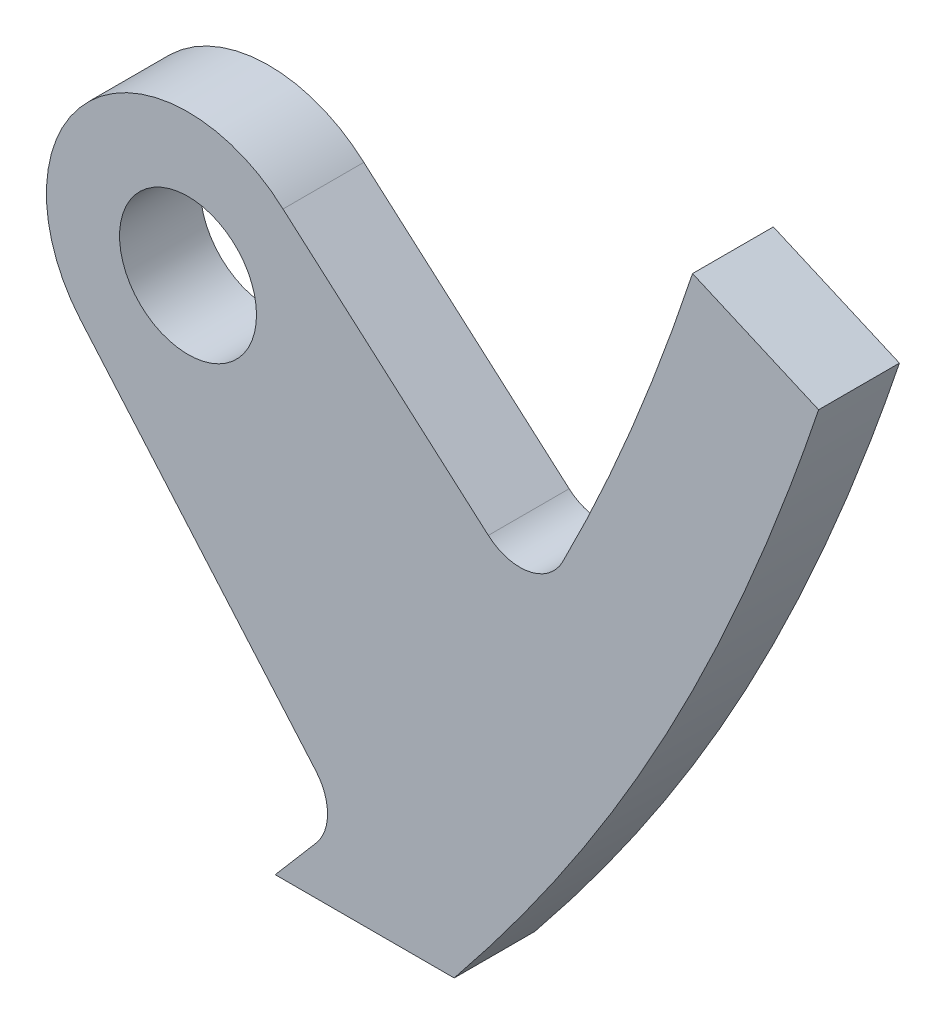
ISO-10303-21;
HEADER;
FILE_DESCRIPTION(('STEP AP214'),'2;1');
FILE_NAME('part.step','',(''),(''),'','','');
FILE_SCHEMA(('AUTOMOTIVE_DESIGN { 1 0 10303 214 1 1 1 1 }'));
ENDSEC;
DATA;
#1=APPLICATION_CONTEXT('core data for automotive mechanical design processes');
#2=APPLICATION_PROTOCOL_DEFINITION('international standard','automotive_design',2000,#1);
#3=PRODUCT_CONTEXT('',#1,'mechanical');
#4=PRODUCT('Part','Part','',(#3));
#5=PRODUCT_RELATED_PRODUCT_CATEGORY('part','',(#4));
#6=PRODUCT_DEFINITION_FORMATION('','',#4);
#7=PRODUCT_DEFINITION_CONTEXT('part definition',#1,'design');
#8=PRODUCT_DEFINITION('design','',#6,#7);
#9=PRODUCT_DEFINITION_SHAPE('','',#8);
#10=(LENGTH_UNIT() NAMED_UNIT(*) SI_UNIT(.MILLI.,.METRE.));
#11=(NAMED_UNIT(*) PLANE_ANGLE_UNIT() SI_UNIT($,.RADIAN.));
#12=(NAMED_UNIT(*) SI_UNIT($,.STERADIAN.) SOLID_ANGLE_UNIT());
#13=UNCERTAINTY_MEASURE_WITH_UNIT(LENGTH_MEASURE(1.E-05),#10,'distance_accuracy_value','');
#14=(GEOMETRIC_REPRESENTATION_CONTEXT(3) GLOBAL_UNCERTAINTY_ASSIGNED_CONTEXT((#13)) GLOBAL_UNIT_ASSIGNED_CONTEXT((#10,
#11,#12)) REPRESENTATION_CONTEXT('',''));
#15=CARTESIAN_POINT('',(0.,0.,0.));
#16=DIRECTION('',(0.,0.,1.));
#17=DIRECTION('',(1.,0.,0.));
#18=AXIS2_PLACEMENT_3D('',#15,#16,#17);
#19=CARTESIAN_POINT('',(-28.575,106.68,2.9972));
#20=CARTESIAN_POINT('',(-31.1223322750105,88.3122925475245,2.9972));
#21=CARTESIAN_POINT('',(-35.6949869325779,54.9592886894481,2.9972));
#22=CARTESIAN_POINT('',(-70.4253531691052,26.7634785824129,2.9972));
#23=CARTESIAN_POINT('',(-76.5696549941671,12.326423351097,2.9972));
#24=CARTESIAN_POINT('',(-76.2,0.,2.9972));
#25=B_SPLINE_CURVE_WITH_KNOTS('',3,(#19,#20,#21,#22,#23,#24),.UNSPECIFIED.,.F.,.F.,(4,1,1,4),
(0.,0.473853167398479,0.807071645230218,1.),.UNSPECIFIED.);
#26=DIRECTION('',(0.,0.,-1.));
#27=VECTOR('',#26,1.);
#28=SURFACE_OF_LINEAR_EXTRUSION('',#25,#27);
#29=CARTESIAN_POINT('',(-35.6183809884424,71.4990097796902,2.9972));
#30=VERTEX_POINT('',#29);
#31=CARTESIAN_POINT('',(-40.4376055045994,59.8291686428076,2.9972));
#32=VERTEX_POINT('',#31);
#33=EDGE_CURVE('E138',#30,#32,#25,.T.);
#34=ORIENTED_EDGE('',*,*,#33,.F.);
#35=DIRECTION('',(0.,0.,-1.));
#36=VECTOR('',#35,1.);
#37=CARTESIAN_POINT('',(-35.618380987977,71.4990097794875,2.9972));
#38=LINE('',#37,#36);
#39=CARTESIAN_POINT('',(-35.6183809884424,71.4990097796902,0.));
#40=VERTEX_POINT('',#39);
#41=EDGE_CURVE('E183',#30,#40,#38,.T.);
#42=ORIENTED_EDGE('',*,*,#41,.T.);
#43=CARTESIAN_POINT('',(-28.575,106.68,0.));
#44=CARTESIAN_POINT('',(-31.1223322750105,88.3122925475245,0.));
#45=CARTESIAN_POINT('',(-35.6949869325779,54.9592886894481,0.));
#46=CARTESIAN_POINT('',(-70.4253531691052,26.7634785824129,0.));
#47=CARTESIAN_POINT('',(-76.5696549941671,12.326423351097,0.));
#48=CARTESIAN_POINT('',(-76.2,0.,0.));
#49=B_SPLINE_CURVE_WITH_KNOTS('',3,(#43,#44,#45,#46,#47,#48),.UNSPECIFIED.,.F.,.F.,(4,1,1,4),
(0.,0.473853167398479,0.807071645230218,1.),.UNSPECIFIED.);
#50=CARTESIAN_POINT('',(-40.4376055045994,59.8291686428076,0.));
#51=VERTEX_POINT('',#50);
#52=EDGE_CURVE('E143',#40,#51,#49,.T.);
#53=ORIENTED_EDGE('',*,*,#52,.T.);
#54=DIRECTION('',(0.,0.,-1.));
#55=VECTOR('',#54,1.);
#56=CARTESIAN_POINT('',(-40.4376055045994,59.8291686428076,0.));
#57=LINE('',#56,#55);
#58=EDGE_CURVE('E186',#51,#32,#57,.F.);
#59=ORIENTED_EDGE('',*,*,#58,.T.);
#60=EDGE_LOOP('',(#34,#42,#53,#59));
#61=FACE_BOUND('',#60,.T.);
#62=ADVANCED_FACE('F33',(#61),#28,.F.);
#63=CARTESIAN_POINT('',(-49.5715588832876,46.2348557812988,0.));
#64=VERTEX_POINT('',#63);
#65=CARTESIAN_POINT('',(-51.0976316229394,44.45,0.));
#66=VERTEX_POINT('',#65);
#67=EDGE_CURVE('E129',#64,#66,#49,.T.);
#68=ORIENTED_EDGE('',*,*,#67,.T.);
#69=DIRECTION('',(0.,0.,-1.));
#70=VECTOR('',#69,1.);
#71=CARTESIAN_POINT('',(-51.0976316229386,44.45,2.9972));
#72=LINE('',#71,#70);
#73=CARTESIAN_POINT('',(-51.0976316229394,44.45,2.9972));
#74=VERTEX_POINT('',#73);
#75=EDGE_CURVE('E112',#66,#74,#72,.F.);
#76=ORIENTED_EDGE('',*,*,#75,.T.);
#77=CARTESIAN_POINT('',(-49.5715588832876,46.2348557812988,2.9972));
#78=VERTEX_POINT('',#77);
#79=EDGE_CURVE('E126',#78,#74,#25,.T.);
#80=ORIENTED_EDGE('',*,*,#79,.F.);
#81=DIRECTION('',(0.,0.,-1.));
#82=VECTOR('',#81,1.);
#83=CARTESIAN_POINT('',(-49.5715588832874,46.2348557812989,2.9972));
#84=LINE('',#83,#82);
#85=EDGE_CURVE('E200',#78,#64,#84,.T.);
#86=ORIENTED_EDGE('',*,*,#85,.T.);
#87=EDGE_LOOP('',(#68,#76,#80,#86));
#88=FACE_BOUND('',#87,.T.);
#89=ADVANCED_FACE('F124',(#88),#28,.F.);
#90=CARTESIAN_POINT('',(-71.12228275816,0.152274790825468,2.9972));
#91=CARTESIAN_POINT('',(-71.1360709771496,0.612053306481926,2.9972));
#92=CARTESIAN_POINT('',(-71.1567058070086,1.54979316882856,2.9972));
#93=CARTESIAN_POINT('',(-71.1645984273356,3.28211812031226,2.9972));
#94=CARTESIAN_POINT('',(-71.1167972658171,5.2861742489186,2.9972));
#95=CARTESIAN_POINT('',(-70.9730711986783,7.42161548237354,2.9972));
#96=CARTESIAN_POINT('',(-70.6767068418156,9.95097976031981,2.9972));
#97=CARTESIAN_POINT('',(-70.1305550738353,12.5718264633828,2.9972));
#98=CARTESIAN_POINT('',(-69.2453812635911,15.104636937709,2.9972));
#99=CARTESIAN_POINT('',(-68.1202374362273,17.3343932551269,2.9972));
#100=CARTESIAN_POINT('',(-66.672184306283,19.5510756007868,2.9972));
#101=CARTESIAN_POINT('',(-64.8630643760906,21.9349302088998,2.9972));
#102=CARTESIAN_POINT('',(-62.1184326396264,25.2082421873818,2.9972));
#103=CARTESIAN_POINT('',(-58.1371910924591,29.5028468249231,2.9972));
#104=CARTESIAN_POINT('',(-52.8597313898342,34.9642275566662,2.9972));
#105=CARTESIAN_POINT('',(-47.4482093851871,40.7915416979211,2.9972));
#106=CARTESIAN_POINT('',(-42.2515146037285,47.0604507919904,2.9972));
#107=CARTESIAN_POINT('',(-37.6918324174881,53.925317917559,2.9972));
#108=CARTESIAN_POINT('',(-34.0642333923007,61.0843459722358,2.9972));
#109=CARTESIAN_POINT('',(-31.169794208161,68.4657942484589,2.9972));
#110=CARTESIAN_POINT('',(-28.9001236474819,75.9824768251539,2.9972));
#111=CARTESIAN_POINT('',(-27.1227122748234,83.5631378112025,2.9972));
#112=CARTESIAN_POINT('',(-25.7154204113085,91.1411224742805,2.9972));
#113=CARTESIAN_POINT('',(-24.7522109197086,97.3940158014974,2.9972));
#114=CARTESIAN_POINT('',(-24.0485885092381,102.335722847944,2.9972));
#115=CARTESIAN_POINT('',(-23.7122461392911,104.762949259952,2.9972));
#116=CARTESIAN_POINT('',(-23.5431598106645,105.98215738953,2.9972));
#117=B_SPLINE_CURVE_WITH_KNOTS('',3,(#90,#91,#92,#93,#94,#95,#96,#97,#98,#99,#100,#101,#102,
#103,#104,#105,#106,#107,#108,#109,#110,#111,#112,#113,#114,#115,#116),.UNSPECIFIED.,.F.,.F.,(4,
1,1,1,1,1,1,1,1,1,1,1,1,1,1,1,1,1,1,1,1,1,1,1,4),(0.,0.0078125,0.015625,0.03125,0.046875,0.0625,
0.09375,0.125,0.15625,0.1875,0.21875,0.25,0.3125,0.375,0.4375,0.5,0.5625,0.625,0.6875,0.75,
0.8125,0.875,0.9375,0.96875,1.),.UNSPECIFIED.);
#118=DIRECTION('',(0.,0.,-1.));
#119=VECTOR('',#118,1.);
#120=SURFACE_OF_LINEAR_EXTRUSION('',#117,#119);
#121=CARTESIAN_POINT('',(-71.12228275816,0.152274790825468,0.));
#122=CARTESIAN_POINT('',(-71.1360709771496,0.612053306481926,0.));
#123=CARTESIAN_POINT('',(-71.1567058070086,1.54979316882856,0.));
#124=CARTESIAN_POINT('',(-71.1645984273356,3.28211812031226,0.));
#125=CARTESIAN_POINT('',(-71.1167972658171,5.2861742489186,0.));
#126=CARTESIAN_POINT('',(-70.9730711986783,7.42161548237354,0.));
#127=CARTESIAN_POINT('',(-70.6767068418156,9.95097976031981,0.));
#128=CARTESIAN_POINT('',(-70.1305550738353,12.5718264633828,0.));
#129=CARTESIAN_POINT('',(-69.2453812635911,15.104636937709,0.));
#130=CARTESIAN_POINT('',(-68.1202374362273,17.3343932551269,0.));
#131=CARTESIAN_POINT('',(-66.672184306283,19.5510756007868,0.));
#132=CARTESIAN_POINT('',(-64.8630643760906,21.9349302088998,0.));
#133=CARTESIAN_POINT('',(-62.1184326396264,25.2082421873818,0.));
#134=CARTESIAN_POINT('',(-58.1371910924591,29.5028468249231,0.));
#135=CARTESIAN_POINT('',(-52.8597313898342,34.9642275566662,0.));
#136=CARTESIAN_POINT('',(-47.4482093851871,40.7915416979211,0.));
#137=CARTESIAN_POINT('',(-42.2515146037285,47.0604507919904,0.));
#138=CARTESIAN_POINT('',(-37.6918324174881,53.925317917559,0.));
#139=CARTESIAN_POINT('',(-34.0642333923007,61.0843459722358,0.));
#140=CARTESIAN_POINT('',(-31.169794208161,68.4657942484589,0.));
#141=CARTESIAN_POINT('',(-28.9001236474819,75.9824768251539,0.));
#142=CARTESIAN_POINT('',(-27.1227122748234,83.5631378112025,0.));
#143=CARTESIAN_POINT('',(-25.7154204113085,91.1411224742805,0.));
#144=CARTESIAN_POINT('',(-24.7522109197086,97.3940158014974,0.));
#145=CARTESIAN_POINT('',(-24.0485885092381,102.335722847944,0.));
#146=CARTESIAN_POINT('',(-23.7122461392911,104.762949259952,0.));
#147=CARTESIAN_POINT('',(-23.5431598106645,105.98215738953,0.));
#148=B_SPLINE_CURVE_WITH_KNOTS('',3,(#121,#122,#123,#124,#125,#126,#127,#128,#129,#130,#131,
#132,#133,#134,#135,#136,#137,#138,#139,#140,#141,#142,#143,#144,#145,#146,#147),.UNSPECIFIED.,
.F.,.F.,(4,1,1,1,1,1,1,1,1,1,1,1,1,1,1,1,1,1,1,1,1,1,1,1,4),(0.,0.0078125,0.015625,0.03125,
0.046875,0.0625,0.09375,0.125,0.15625,0.1875,0.21875,0.25,0.3125,0.375,0.4375,0.5,0.5625,0.625,
0.6875,0.75,0.8125,0.875,0.9375,0.96875,1.),.UNSPECIFIED.);
#149=CARTESIAN_POINT('',(-44.459383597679,44.45,0.));
#150=VERTEX_POINT('',#149);
#151=CARTESIAN_POINT('',(-30.9421428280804,69.4618367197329,0.));
#152=VERTEX_POINT('',#151);
#153=EDGE_CURVE('E139',#150,#152,#148,.T.);
#154=ORIENTED_EDGE('',*,*,#153,.T.);
#155=DIRECTION('',(0.,0.,-1.));
#156=VECTOR('',#155,1.);
#157=CARTESIAN_POINT('',(-30.9421428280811,69.4618367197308,2.9972));
#158=LINE('',#157,#156);
#159=CARTESIAN_POINT('',(-30.9421428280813,69.4618367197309,2.9972));
#160=VERTEX_POINT('',#159);
#161=EDGE_CURVE('E48',#152,#160,#158,.F.);
#162=ORIENTED_EDGE('',*,*,#161,.T.);
#163=CARTESIAN_POINT('',(-44.459383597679,44.45,2.9972));
#164=VERTEX_POINT('',#163);
#165=EDGE_CURVE('E141',#164,#160,#117,.T.);
#166=ORIENTED_EDGE('',*,*,#165,.F.);
#167=DIRECTION('',(0.,0.,1.));
#168=VECTOR('',#167,1.);
#169=CARTESIAN_POINT('',(-44.459383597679,44.45,0.));
#170=LINE('',#169,#168);
#171=EDGE_CURVE('E115',#150,#164,#170,.T.);
#172=ORIENTED_EDGE('',*,*,#171,.F.);
#173=EDGE_LOOP('',(#154,#162,#166,#172));
#174=FACE_BOUND('',#173,.T.);
#175=ADVANCED_FACE('F160',(#174),#120,.F.);
#176=CARTESIAN_POINT('',(-46.430466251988,50.1960313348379,2.9972));
#177=DIRECTION('',(0.,0.,1.));
#178=DIRECTION('',(1.,0.,0.));
#179=AXIS2_PLACEMENT_3D('',#176,#177,#178);
#180=PLANE('',#179);
#181=DIRECTION('',(0.916781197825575,-0.399389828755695,0.));
#182=VECTOR('',#181,1.);
#183=CARTESIAN_POINT('',(-43.3685838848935,74.8753357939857,2.9972));
#184=LINE('',#183,#182);
#185=EDGE_CURVE('E130',#30,#160,#184,.T.);
#186=ORIENTED_EDGE('',*,*,#185,.F.);
#187=ORIENTED_EDGE('',*,*,#33,.T.);
#188=CARTESIAN_POINT('',(-42.0207648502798,60.6384216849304,2.9972));
#189=DIRECTION('',(0.,0.,1.));
#190=DIRECTION('',(1.,0.,0.));
#191=AXIS2_PLACEMENT_3D('',#188,#189,#190);
#192=CIRCLE('',#191,1.778);
#193=CARTESIAN_POINT('',(-43.1927780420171,59.3013842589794,2.9972));
#194=VERTEX_POINT('',#193);
#195=EDGE_CURVE('E55',#32,#194,#192,.F.);
#196=ORIENTED_EDGE('',*,*,#195,.T.);
#197=DIRECTION('',(-0.751989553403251,0.659175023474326,0.));
#198=VECTOR('',#197,1.);
#199=CARTESIAN_POINT('',(-39.0309458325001,55.6532274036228,2.9972));
#200=LINE('',#199,#198);
#201=CARTESIAN_POINT('',(-50.8086045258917,65.9772251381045,2.9972));
#202=VERTEX_POINT('',#201);
#203=EDGE_CURVE('E220',#194,#202,#200,.T.);
#204=ORIENTED_EDGE('',*,*,#203,.T.);
#205=CARTESIAN_POINT('',(-54.3317843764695,62.0810371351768,2.9972));
#206=DIRECTION('',(0.,0.,1.));
#207=DIRECTION('',(-1.,0.,0.));
#208=AXIS2_PLACEMENT_3D('',#205,#206,#207);
#209=CIRCLE('',#208,5.25291130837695);
#210=CARTESIAN_POINT('',(-58.3361305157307,58.6812887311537,2.9972));
#211=VERTEX_POINT('',#210);
#212=EDGE_CURVE('E225',#202,#211,#209,.T.);
#213=ORIENTED_EDGE('',*,*,#212,.T.);
#214=DIRECTION('',(0.653074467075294,-0.757293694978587,0.));
#215=VECTOR('',#214,1.);
#216=CARTESIAN_POINT('',(-58.3361305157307,58.6812887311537,2.9972));
#217=LINE('',#216,#215);
#218=CARTESIAN_POINT('',(-49.5883128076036,48.5374727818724,2.9972));
#219=VERTEX_POINT('',#218);
#220=EDGE_CURVE('E223',#211,#219,#217,.T.);
#221=ORIENTED_EDGE('',*,*,#220,.T.);
#222=CARTESIAN_POINT('',(-50.9347809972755,47.3763063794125,2.9972));
#223=DIRECTION('',(0.,0.,1.));
#224=DIRECTION('',(1.,0.,0.));
#225=AXIS2_PLACEMENT_3D('',#222,#223,#224);
#226=CIRCLE('',#225,1.778);
#227=EDGE_CURVE('E137',#219,#78,#226,.F.);
#228=ORIENTED_EDGE('',*,*,#227,.T.);
#229=ORIENTED_EDGE('',*,*,#79,.T.);
#230=DIRECTION('',(-1.,0.,0.));
#231=VECTOR('',#230,1.);
#232=CARTESIAN_POINT('',(-44.459383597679,44.45,2.9972));
#233=LINE('',#232,#231);
#234=EDGE_CURVE('E109',#164,#74,#233,.T.);
#235=ORIENTED_EDGE('',*,*,#234,.F.);
#236=ORIENTED_EDGE('',*,*,#165,.T.);
#237=EDGE_LOOP('',(#186,#187,#196,#204,#213,#221,#228,#229,#235,#236));
#238=FACE_BOUND('',#237,.T.);
#239=CARTESIAN_POINT('',(-54.3317843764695,62.0810371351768,2.9972));
#240=DIRECTION('',(0.,0.,1.));
#241=DIRECTION('',(1.,0.,0.));
#242=AXIS2_PLACEMENT_3D('',#239,#240,#241);
#243=CIRCLE('',#242,2.54);
#244=CARTESIAN_POINT('',(-51.7917843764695,62.0810371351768,2.9972));
#245=VERTEX_POINT('',#244);
#246=EDGE_CURVE('E235',#245,#245,#243,.T.);
#247=ORIENTED_EDGE('',*,*,#246,.F.);
#248=EDGE_LOOP('',(#247));
#249=FACE_BOUND('',#248,.T.);
#250=ADVANCED_FACE('F133',(#238,#249),#180,.T.);
#251=CARTESIAN_POINT('',(-46.430466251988,50.1960313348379,0.));
#252=DIRECTION('',(0.,0.,1.));
#253=DIRECTION('',(1.,0.,0.));
#254=AXIS2_PLACEMENT_3D('',#251,#252,#253);
#255=PLANE('',#254);
#256=ORIENTED_EDGE('',*,*,#52,.F.);
#257=DIRECTION('',(0.916781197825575,-0.399389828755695,0.));
#258=VECTOR('',#257,1.);
#259=CARTESIAN_POINT('',(-36.9056550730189,72.0598024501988,0.));
#260=LINE('',#259,#258);
#261=EDGE_CURVE('E11',#40,#152,#260,.T.);
#262=ORIENTED_EDGE('',*,*,#261,.T.);
#263=ORIENTED_EDGE('',*,*,#153,.F.);
#264=DIRECTION('',(-1.,0.,0.));
#265=VECTOR('',#264,1.);
#266=CARTESIAN_POINT('',(-44.459383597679,44.45,0.));
#267=LINE('',#266,#265);
#268=EDGE_CURVE('E119',#150,#66,#267,.T.);
#269=ORIENTED_EDGE('',*,*,#268,.T.);
#270=ORIENTED_EDGE('',*,*,#67,.F.);
#271=CARTESIAN_POINT('',(-50.9347809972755,47.3763063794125,0.));
#272=DIRECTION('',(0.,0.,1.));
#273=DIRECTION('',(1.,0.,0.));
#274=AXIS2_PLACEMENT_3D('',#271,#272,#273);
#275=CIRCLE('',#274,1.778);
#276=CARTESIAN_POINT('',(-49.5883128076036,48.5374727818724,0.));
#277=VERTEX_POINT('',#276);
#278=EDGE_CURVE('E192',#64,#277,#275,.T.);
#279=ORIENTED_EDGE('',*,*,#278,.T.);
#280=DIRECTION('',(0.653074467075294,-0.757293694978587,0.));
#281=VECTOR('',#280,1.);
#282=CARTESIAN_POINT('',(-58.3361305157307,58.6812887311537,0.));
#283=LINE('',#282,#281);
#284=CARTESIAN_POINT('',(-58.3361305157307,58.6812887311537,0.));
#285=VERTEX_POINT('',#284);
#286=EDGE_CURVE('E230',#285,#277,#283,.T.);
#287=ORIENTED_EDGE('',*,*,#286,.F.);
#288=CARTESIAN_POINT('',(-54.3317843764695,62.0810371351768,0.));
#289=DIRECTION('',(0.,0.,1.));
#290=DIRECTION('',(-1.,0.,0.));
#291=AXIS2_PLACEMENT_3D('',#288,#289,#290);
#292=CIRCLE('',#291,5.25291130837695);
#293=CARTESIAN_POINT('',(-50.8086045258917,65.9772251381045,0.));
#294=VERTEX_POINT('',#293);
#295=EDGE_CURVE('E222',#294,#285,#292,.T.);
#296=ORIENTED_EDGE('',*,*,#295,.F.);
#297=DIRECTION('',(-0.751989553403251,0.659175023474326,0.));
#298=VECTOR('',#297,1.);
#299=CARTESIAN_POINT('',(-39.0309458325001,55.6532274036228,0.));
#300=LINE('',#299,#298);
#301=CARTESIAN_POINT('',(-43.1927780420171,59.3013842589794,0.));
#302=VERTEX_POINT('',#301);
#303=EDGE_CURVE('E217',#302,#294,#300,.T.);
#304=ORIENTED_EDGE('',*,*,#303,.F.);
#305=CARTESIAN_POINT('',(-42.0207648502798,60.6384216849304,0.));
#306=DIRECTION('',(0.,0.,1.));
#307=DIRECTION('',(1.,0.,0.));
#308=AXIS2_PLACEMENT_3D('',#305,#306,#307);
#309=CIRCLE('',#308,1.778);
#310=EDGE_CURVE('E41',#302,#51,#309,.T.);
#311=ORIENTED_EDGE('',*,*,#310,.T.);
#312=EDGE_LOOP('',(#256,#262,#263,#269,#270,#279,#287,#296,#304,#311));
#313=FACE_BOUND('',#312,.T.);
#314=CARTESIAN_POINT('',(-54.3317843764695,62.0810371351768,0.));
#315=DIRECTION('',(0.,0.,1.));
#316=DIRECTION('',(1.,0.,0.));
#317=AXIS2_PLACEMENT_3D('',#314,#315,#316);
#318=CIRCLE('',#317,2.54);
#319=CARTESIAN_POINT('',(-51.7917843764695,62.0810371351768,0.));
#320=VERTEX_POINT('',#319);
#321=EDGE_CURVE('E228',#320,#320,#318,.T.);
#322=ORIENTED_EDGE('',*,*,#321,.T.);
#323=EDGE_LOOP('',(#322));
#324=FACE_BOUND('',#323,.T.);
#325=ADVANCED_FACE('F243',(#313,#324),#255,.F.);
#326=CARTESIAN_POINT('',(-44.459383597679,44.45,0.));
#327=DIRECTION('',(0.,1.,0.));
#328=DIRECTION('',(-1.,0.,0.));
#329=AXIS2_PLACEMENT_3D('',#326,#327,#328);
#330=PLANE('',#329);
#331=ORIENTED_EDGE('',*,*,#234,.T.);
#332=ORIENTED_EDGE('',*,*,#75,.F.);
#333=ORIENTED_EDGE('',*,*,#268,.F.);
#334=ORIENTED_EDGE('',*,*,#171,.T.);
#335=EDGE_LOOP('',(#331,#332,#333,#334));
#336=FACE_BOUND('',#335,.T.);
#337=ADVANCED_FACE('F111',(#336),#330,.F.);
#338=CARTESIAN_POINT('',(-39.0309458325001,55.6532274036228,0.));
#339=DIRECTION('',(0.659175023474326,0.751989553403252,0.));
#340=DIRECTION('',(-0.751989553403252,0.659175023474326,0.));
#341=AXIS2_PLACEMENT_3D('',#338,#339,#340);
#342=PLANE('',#341);
#343=ORIENTED_EDGE('',*,*,#203,.F.);
#344=DIRECTION('',(0.,0.,-1.));
#345=VECTOR('',#344,1.);
#346=CARTESIAN_POINT('',(-43.1927780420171,59.3013842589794,0.));
#347=LINE('',#346,#345);
#348=EDGE_CURVE('E189',#194,#302,#347,.T.);
#349=ORIENTED_EDGE('',*,*,#348,.T.);
#350=ORIENTED_EDGE('',*,*,#303,.T.);
#351=DIRECTION('',(0.,0.,1.));
#352=VECTOR('',#351,1.);
#353=CARTESIAN_POINT('',(-50.8086045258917,65.9772251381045,0.));
#354=LINE('',#353,#352);
#355=EDGE_CURVE('E120',#294,#202,#354,.T.);
#356=ORIENTED_EDGE('',*,*,#355,.T.);
#357=EDGE_LOOP('',(#343,#349,#350,#356));
#358=FACE_BOUND('',#357,.T.);
#359=ADVANCED_FACE('F250',(#358),#342,.T.);
#360=CARTESIAN_POINT('',(-58.3361305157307,58.6812887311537,0.));
#361=DIRECTION('',(-0.757293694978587,-0.653074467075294,0.));
#362=DIRECTION('',(0.653074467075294,-0.757293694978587,0.));
#363=AXIS2_PLACEMENT_3D('',#360,#361,#362);
#364=PLANE('',#363);
#365=ORIENTED_EDGE('',*,*,#286,.T.);
#366=DIRECTION('',(0.,0.,-1.));
#367=VECTOR('',#366,1.);
#368=CARTESIAN_POINT('',(-49.5883128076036,48.5374727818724,0.));
#369=LINE('',#368,#367);
#370=EDGE_CURVE('E198',#277,#219,#369,.F.);
#371=ORIENTED_EDGE('',*,*,#370,.T.);
#372=ORIENTED_EDGE('',*,*,#220,.F.);
#373=DIRECTION('',(0.,0.,1.));
#374=VECTOR('',#373,1.);
#375=CARTESIAN_POINT('',(-58.3361305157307,58.6812887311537,0.));
#376=LINE('',#375,#374);
#377=EDGE_CURVE('E215',#285,#211,#376,.T.);
#378=ORIENTED_EDGE('',*,*,#377,.F.);
#379=EDGE_LOOP('',(#365,#371,#372,#378));
#380=FACE_BOUND('',#379,.T.);
#381=ADVANCED_FACE('F256',(#380),#364,.T.);
#382=CARTESIAN_POINT('',(-54.3317843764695,62.0810371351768,0.));
#383=DIRECTION('',(0.,0.,1.));
#384=DIRECTION('',(1.,0.,0.));
#385=AXIS2_PLACEMENT_3D('',#382,#383,#384);
#386=CYLINDRICAL_SURFACE('',#385,5.25291130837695);
#387=ORIENTED_EDGE('',*,*,#212,.F.);
#388=ORIENTED_EDGE('',*,*,#355,.F.);
#389=ORIENTED_EDGE('',*,*,#295,.T.);
#390=ORIENTED_EDGE('',*,*,#377,.T.);
#391=EDGE_LOOP('',(#387,#388,#389,#390));
#392=FACE_BOUND('',#391,.T.);
#393=ADVANCED_FACE('F172',(#392),#386,.T.);
#394=CARTESIAN_POINT('',(-54.3317843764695,62.0810371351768,0.));
#395=DIRECTION('',(0.,0.,1.));
#396=DIRECTION('',(1.,0.,0.));
#397=AXIS2_PLACEMENT_3D('',#394,#395,#396);
#398=CYLINDRICAL_SURFACE('',#397,2.54);
#399=CARTESIAN_POINT('',(-51.7917843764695,62.0810371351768,0.));
#400=CARTESIAN_POINT('',(-51.7917843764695,62.0810371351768,0.0312208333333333));
#401=CARTESIAN_POINT('',(-51.7917843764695,62.0810371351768,0.0624416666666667));
#402=CARTESIAN_POINT('',(-51.7917843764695,62.0810371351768,0.124883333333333));
#403=CARTESIAN_POINT('',(-51.7917843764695,62.0810371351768,0.156104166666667));
#404=CARTESIAN_POINT('',(-51.7917843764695,62.0810371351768,0.218545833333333));
#405=CARTESIAN_POINT('',(-51.7917843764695,62.0810371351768,0.249766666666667));
#406=CARTESIAN_POINT('',(-51.7917843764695,62.0810371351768,0.312208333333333));
#407=CARTESIAN_POINT('',(-51.7917843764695,62.0810371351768,0.343429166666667));
#408=CARTESIAN_POINT('',(-51.7917843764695,62.0810371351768,0.405870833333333));
#409=CARTESIAN_POINT('',(-51.7917843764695,62.0810371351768,0.437091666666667));
#410=CARTESIAN_POINT('',(-51.7917843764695,62.0810371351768,0.499533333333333));
#411=CARTESIAN_POINT('',(-51.7917843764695,62.0810371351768,0.530754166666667));
#412=CARTESIAN_POINT('',(-51.7917843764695,62.0810371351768,0.593195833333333));
#413=CARTESIAN_POINT('',(-51.7917843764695,62.0810371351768,0.624416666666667));
#414=CARTESIAN_POINT('',(-51.7917843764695,62.0810371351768,0.686858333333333));
#415=CARTESIAN_POINT('',(-51.7917843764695,62.0810371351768,0.718079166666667));
#416=CARTESIAN_POINT('',(-51.7917843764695,62.0810371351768,0.780520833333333));
#417=CARTESIAN_POINT('',(-51.7917843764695,62.0810371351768,0.811741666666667));
#418=CARTESIAN_POINT('',(-51.7917843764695,62.0810371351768,0.874183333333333));
#419=CARTESIAN_POINT('',(-51.7917843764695,62.0810371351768,0.905404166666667));
#420=CARTESIAN_POINT('',(-51.7917843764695,62.0810371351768,0.967845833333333));
#421=CARTESIAN_POINT('',(-51.7917843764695,62.0810371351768,0.999066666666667));
#422=CARTESIAN_POINT('',(-51.7917843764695,62.0810371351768,1.06150833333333));
#423=CARTESIAN_POINT('',(-51.7917843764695,62.0810371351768,1.09272916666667));
#424=CARTESIAN_POINT('',(-51.7917843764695,62.0810371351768,1.15517083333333));
#425=CARTESIAN_POINT('',(-51.7917843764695,62.0810371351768,1.18639166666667));
#426=CARTESIAN_POINT('',(-51.7917843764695,62.0810371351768,1.24883333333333));
#427=CARTESIAN_POINT('',(-51.7917843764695,62.0810371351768,1.28005416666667));
#428=CARTESIAN_POINT('',(-51.7917843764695,62.0810371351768,1.34249583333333));
#429=CARTESIAN_POINT('',(-51.7917843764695,62.0810371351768,1.37371666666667));
#430=CARTESIAN_POINT('',(-51.7917843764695,62.0810371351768,1.43615833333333));
#431=CARTESIAN_POINT('',(-51.7917843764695,62.0810371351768,1.46737916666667));
#432=CARTESIAN_POINT('',(-51.7917843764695,62.0810371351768,1.52982083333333));
#433=CARTESIAN_POINT('',(-51.7917843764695,62.0810371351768,1.56104166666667));
#434=CARTESIAN_POINT('',(-51.7917843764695,62.0810371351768,1.62348333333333));
#435=CARTESIAN_POINT('',(-51.7917843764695,62.0810371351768,1.65470416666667));
#436=CARTESIAN_POINT('',(-51.7917843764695,62.0810371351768,1.71714583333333));
#437=CARTESIAN_POINT('',(-51.7917843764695,62.0810371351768,1.74836666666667));
#438=CARTESIAN_POINT('',(-51.7917843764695,62.0810371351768,1.81080833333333));
#439=CARTESIAN_POINT('',(-51.7917843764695,62.0810371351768,1.84202916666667));
#440=CARTESIAN_POINT('',(-51.7917843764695,62.0810371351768,1.90447083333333));
#441=CARTESIAN_POINT('',(-51.7917843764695,62.0810371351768,1.93569166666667));
#442=CARTESIAN_POINT('',(-51.7917843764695,62.0810371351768,1.99813333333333));
#443=CARTESIAN_POINT('',(-51.7917843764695,62.0810371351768,2.02935416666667));
#444=CARTESIAN_POINT('',(-51.7917843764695,62.0810371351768,2.09179583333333));
#445=CARTESIAN_POINT('',(-51.7917843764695,62.0810371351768,2.12301666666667));
#446=CARTESIAN_POINT('',(-51.7917843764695,62.0810371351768,2.18545833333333));
#447=CARTESIAN_POINT('',(-51.7917843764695,62.0810371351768,2.21667916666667));
#448=CARTESIAN_POINT('',(-51.7917843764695,62.0810371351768,2.27912083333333));
#449=CARTESIAN_POINT('',(-51.7917843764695,62.0810371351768,2.31034166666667));
#450=CARTESIAN_POINT('',(-51.7917843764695,62.0810371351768,2.37278333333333));
#451=CARTESIAN_POINT('',(-51.7917843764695,62.0810371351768,2.40400416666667));
#452=CARTESIAN_POINT('',(-51.7917843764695,62.0810371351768,2.46644583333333));
#453=CARTESIAN_POINT('',(-51.7917843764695,62.0810371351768,2.49766666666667));
#454=CARTESIAN_POINT('',(-51.7917843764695,62.0810371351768,2.56010833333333));
#455=CARTESIAN_POINT('',(-51.7917843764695,62.0810371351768,2.59132916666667));
#456=CARTESIAN_POINT('',(-51.7917843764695,62.0810371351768,2.65377083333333));
#457=CARTESIAN_POINT('',(-51.7917843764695,62.0810371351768,2.68499166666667));
#458=CARTESIAN_POINT('',(-51.7917843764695,62.0810371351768,2.74743333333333));
#459=CARTESIAN_POINT('',(-51.7917843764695,62.0810371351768,2.77865416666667));
#460=CARTESIAN_POINT('',(-51.7917843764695,62.0810371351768,2.84109583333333));
#461=CARTESIAN_POINT('',(-51.7917843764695,62.0810371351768,2.87231666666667));
#462=CARTESIAN_POINT('',(-51.7917843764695,62.0810371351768,2.93475833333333));
#463=CARTESIAN_POINT('',(-51.7917843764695,62.0810371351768,2.96597916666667));
#464=CARTESIAN_POINT('',(-51.7917843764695,62.0810371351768,2.9972));
#465=B_SPLINE_CURVE_WITH_KNOTS('',3,(#399,#400,#401,#402,#403,#404,#405,#406,#407,#408,#409,
#410,#411,#412,#413,#414,#415,#416,#417,#418,#419,#420,#421,#422,#423,#424,#425,#426,#427,#428,
#429,#430,#431,#432,#433,#434,#435,#436,#437,#438,#439,#440,#441,#442,#443,#444,#445,#446,#447,
#448,#449,#450,#451,#452,#453,#454,#455,#456,#457,#458,#459,#460,#461,#462,#463,#464),
.UNSPECIFIED.,.F.,.F.,(4,2,2,2,2,2,2,2,2,2,2,2,2,2,2,2,2,2,2,2,2,2,2,2,2,2,2,2,2,2,2,2,4),(0.,
0.0936625,0.187325,0.2809875,0.37465,0.4683125,0.561975,0.6556375,0.7493,0.8429625,0.936625,
1.0302875,1.12395,1.2176125,1.311275,1.4049375,1.4986,1.5922625,1.685925,1.7795875,1.87325,
1.9669125,2.060575,2.1542375,2.2479,2.3415625,2.435225,2.5288875,2.62255,2.7162125,2.809875,
2.9035375,2.9972),.UNSPECIFIED.);
#466=EDGE_CURVE('BSEAM164',#320,#245,#465,.T.);
#467=ORIENTED_EDGE('',*,*,#321,.F.);
#468=ORIENTED_EDGE('',*,*,#246,.T.);
#469=ORIENTED_EDGE('',*,*,#466,.T.);
#470=ORIENTED_EDGE('',*,*,#466,.F.);
#471=EDGE_LOOP('',(#467,#469,#468,#470));
#472=FACE_BOUND('',#471,.T.);
#473=ADVANCED_FACE('F164',(#472),#398,.F.);
#474=CARTESIAN_POINT('',(-50.9347809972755,47.3763063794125,1.4986));
#475=DIRECTION('',(0.,0.,-1.));
#476=DIRECTION('',(-1.,0.,0.));
#477=AXIS2_PLACEMENT_3D('',#474,#475,#476);
#478=CYLINDRICAL_SURFACE('',#477,1.778);
#479=ORIENTED_EDGE('',*,*,#227,.F.);
#480=ORIENTED_EDGE('',*,*,#370,.F.);
#481=ORIENTED_EDGE('',*,*,#278,.F.);
#482=ORIENTED_EDGE('',*,*,#85,.F.);
#483=EDGE_LOOP('',(#479,#480,#481,#482));
#484=FACE_BOUND('',#483,.T.);
#485=ADVANCED_FACE('F162',(#484),#478,.F.);
#486=CARTESIAN_POINT('',(-42.0207648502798,60.6384216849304,1.4986));
#487=DIRECTION('',(0.,0.,-1.));
#488=DIRECTION('',(-1.,0.,0.));
#489=AXIS2_PLACEMENT_3D('',#486,#487,#488);
#490=CYLINDRICAL_SURFACE('',#489,1.778);
#491=ORIENTED_EDGE('',*,*,#310,.F.);
#492=ORIENTED_EDGE('',*,*,#348,.F.);
#493=ORIENTED_EDGE('',*,*,#195,.F.);
#494=ORIENTED_EDGE('',*,*,#58,.F.);
#495=EDGE_LOOP('',(#491,#492,#493,#494));
#496=FACE_BOUND('',#495,.T.);
#497=ADVANCED_FACE('F35',(#496),#490,.F.);
#498=CARTESIAN_POINT('',(-43.3685838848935,74.8753357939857,-4.6228));
#499=DIRECTION('',(-0.399389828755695,-0.916781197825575,0.));
#500=DIRECTION('',(0.916781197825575,-0.399389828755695,0.));
#501=AXIS2_PLACEMENT_3D('',#498,#499,#500);
#502=PLANE('',#501);
#503=ORIENTED_EDGE('',*,*,#185,.T.);
#504=ORIENTED_EDGE('',*,*,#161,.F.);
#505=ORIENTED_EDGE('',*,*,#261,.F.);
#506=ORIENTED_EDGE('',*,*,#41,.F.);
#507=EDGE_LOOP('',(#503,#504,#505,#506));
#508=FACE_BOUND('',#507,.T.);
#509=ADVANCED_FACE('F170',(#508),#502,.F.);
#510=CLOSED_SHELL('',(#62,#89,#175,#250,#325,#337,#359,#381,#393,#473,#485,#497,#509));
#511=MANIFOLD_SOLID_BREP('B2',#510);
#512=ADVANCED_BREP_SHAPE_REPRESENTATION('',(#18,#511),#14);
#513=SHAPE_DEFINITION_REPRESENTATION(#9,#512);
ENDSEC;
END-ISO-10303-21;
